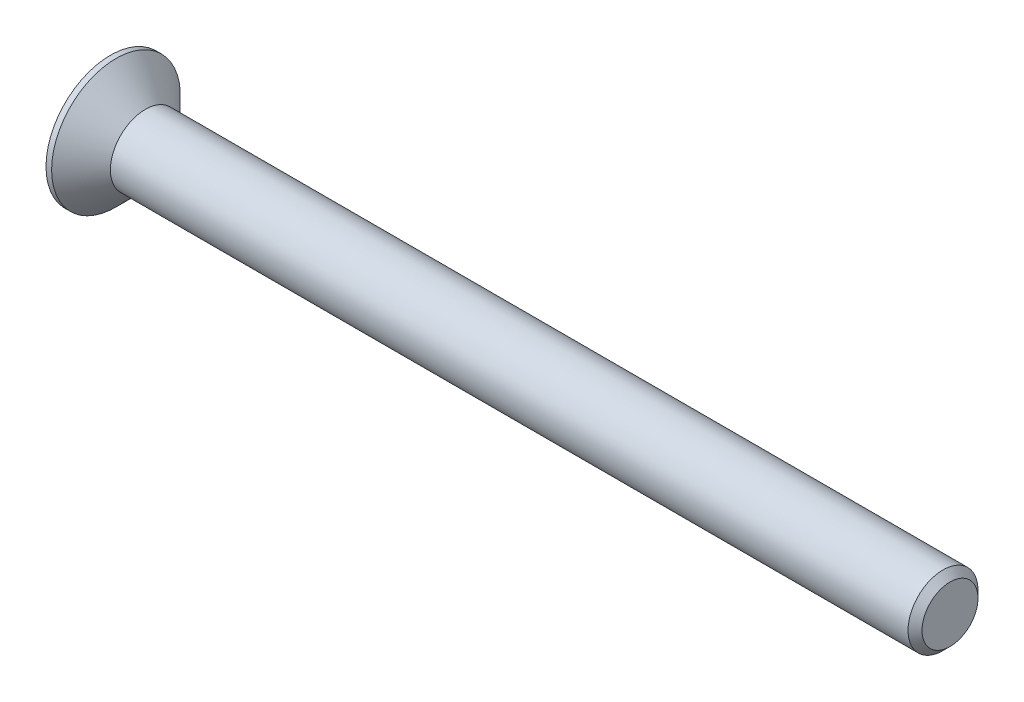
ISO-10303-21;
HEADER;
FILE_DESCRIPTION(('STEP AP214'),'2;1');
FILE_NAME('part.step','',(''),(''),'','','');
FILE_SCHEMA(('AUTOMOTIVE_DESIGN { 1 0 10303 214 1 1 1 1 }'));
ENDSEC;
DATA;
#1=APPLICATION_CONTEXT('core data for automotive mechanical design processes');
#2=APPLICATION_PROTOCOL_DEFINITION('international standard','automotive_design',2000,#1);
#3=PRODUCT_CONTEXT('',#1,'mechanical');
#4=PRODUCT('Part','Part','',(#3));
#5=PRODUCT_RELATED_PRODUCT_CATEGORY('part','',(#4));
#6=PRODUCT_DEFINITION_FORMATION('','',#4);
#7=PRODUCT_DEFINITION_CONTEXT('part definition',#1,'design');
#8=PRODUCT_DEFINITION('design','',#6,#7);
#9=PRODUCT_DEFINITION_SHAPE('','',#8);
#10=(LENGTH_UNIT() NAMED_UNIT(*) SI_UNIT(.MILLI.,.METRE.));
#11=(NAMED_UNIT(*) PLANE_ANGLE_UNIT() SI_UNIT($,.RADIAN.));
#12=(NAMED_UNIT(*) SI_UNIT($,.STERADIAN.) SOLID_ANGLE_UNIT());
#13=UNCERTAINTY_MEASURE_WITH_UNIT(LENGTH_MEASURE(1.E-05),#10,'distance_accuracy_value','');
#14=(GEOMETRIC_REPRESENTATION_CONTEXT(3) GLOBAL_UNCERTAINTY_ASSIGNED_CONTEXT((#13)) GLOBAL_UNIT_ASSIGNED_CONTEXT((#10,
#11,#12)) REPRESENTATION_CONTEXT('',''));
#15=CARTESIAN_POINT('',(0.,0.,0.));
#16=DIRECTION('',(0.,0.,1.));
#17=DIRECTION('',(1.,0.,0.));
#18=AXIS2_PLACEMENT_3D('',#15,#16,#17);
#19=CARTESIAN_POINT('',(0.,0.,0.));
#20=DIRECTION('',(-1.,0.,0.));
#21=DIRECTION('',(0.,0.,1.));
#22=AXIS2_PLACEMENT_3D('',#19,#20,#21);
#23=CONICAL_SURFACE('',#22,2.5,0.78539816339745);
#24=CARTESIAN_POINT('',(-2.09999999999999,0.,0.));
#25=DIRECTION('',(-1.,0.,0.));
#26=DIRECTION('',(0.,0.,1.));
#27=AXIS2_PLACEMENT_3D('',#24,#25,#26);
#28=CIRCLE('',#27,4.6);
#29=CARTESIAN_POINT('',(-2.09999999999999,0.,4.6));
#30=VERTEX_POINT('',#29);
#31=EDGE_CURVE('E189',#30,#30,#28,.T.);
#32=ORIENTED_EDGE('',*,*,#31,.F.);
#33=EDGE_LOOP('',(#32));
#34=FACE_BOUND('',#33,.T.);
#35=CARTESIAN_POINT('',(0.,0.,0.));
#36=DIRECTION('',(-1.,0.,0.));
#37=DIRECTION('',(0.,0.,1.));
#38=AXIS2_PLACEMENT_3D('',#35,#36,#37);
#39=CIRCLE('',#38,2.5);
#40=CARTESIAN_POINT('',(0.,0.,2.5));
#41=VERTEX_POINT('',#40);
#42=EDGE_CURVE('E212',#41,#41,#39,.T.);
#43=ORIENTED_EDGE('',*,*,#42,.T.);
#44=EDGE_LOOP('',(#43));
#45=FACE_BOUND('',#44,.T.);
#46=ADVANCED_FACE('F33',(#34,#45),#23,.T.);
#47=CARTESIAN_POINT('',(-2.5,0.,0.));
#48=DIRECTION('',(-1.,0.,0.));
#49=DIRECTION('',(0.,0.,1.));
#50=AXIS2_PLACEMENT_3D('',#47,#48,#49);
#51=CYLINDRICAL_SURFACE('',#50,2.5);
#52=CARTESIAN_POINT('',(57.,0.,0.));
#53=DIRECTION('',(-1.,0.,0.));
#54=DIRECTION('',(0.,0.,1.));
#55=AXIS2_PLACEMENT_3D('',#52,#53,#54);
#56=CIRCLE('',#55,2.5);
#57=CARTESIAN_POINT('',(57.,0.,2.5));
#58=VERTEX_POINT('',#57);
#59=EDGE_CURVE('E41',#58,#58,#56,.T.);
#60=ORIENTED_EDGE('',*,*,#59,.T.);
#61=EDGE_LOOP('',(#60));
#62=FACE_BOUND('',#61,.T.);
#63=ORIENTED_EDGE('',*,*,#42,.F.);
#64=EDGE_LOOP('',(#63));
#65=FACE_BOUND('',#64,.T.);
#66=ADVANCED_FACE('F217',(#62,#65),#51,.T.);
#67=CARTESIAN_POINT('',(57.5,0.,0.));
#68=DIRECTION('',(-1.,0.,0.));
#69=DIRECTION('',(0.,0.,1.));
#70=AXIS2_PLACEMENT_3D('',#67,#68,#69);
#71=PLANE('',#70);
#72=CARTESIAN_POINT('',(57.5,0.,0.));
#73=DIRECTION('',(-1.,0.,0.));
#74=DIRECTION('',(0.,0.,1.));
#75=AXIS2_PLACEMENT_3D('',#72,#73,#74);
#76=CIRCLE('',#75,2.);
#77=CARTESIAN_POINT('',(57.5,0.,2.));
#78=VERTEX_POINT('',#77);
#79=EDGE_CURVE('E11',#78,#78,#76,.F.);
#80=ORIENTED_EDGE('',*,*,#79,.T.);
#81=EDGE_LOOP('',(#80));
#82=FACE_BOUND('',#81,.T.);
#83=ADVANCED_FACE('F239',(#82),#71,.F.);
#84=CARTESIAN_POINT('',(-2.5,4.6,0.));
#85=DIRECTION('',(1.,0.,0.));
#86=DIRECTION('',(0.,0.,-1.));
#87=AXIS2_PLACEMENT_3D('',#84,#85,#86);
#88=PLANE('',#87);
#89=DIRECTION('',(0.,0.,-1.));
#90=VECTOR('',#89,1.);
#91=CARTESIAN_POINT('',(-2.5,0.575,-2.3));
#92=LINE('',#91,#90);
#93=CARTESIAN_POINT('',(-2.5,0.575,-0.575));
#94=VERTEX_POINT('',#93);
#95=CARTESIAN_POINT('',(-2.5,0.575,-2.3));
#96=VERTEX_POINT('',#95);
#97=EDGE_CURVE('E158',#94,#96,#92,.T.);
#98=ORIENTED_EDGE('',*,*,#97,.F.);
#99=DIRECTION('',(0.,-1.,0.));
#100=VECTOR('',#99,1.);
#101=CARTESIAN_POINT('',(-2.5,0.575,-0.575));
#102=LINE('',#101,#100);
#103=CARTESIAN_POINT('',(-2.5,2.3,-0.575));
#104=VERTEX_POINT('',#103);
#105=EDGE_CURVE('E48',#104,#94,#102,.T.);
#106=ORIENTED_EDGE('',*,*,#105,.F.);
#107=DIRECTION('',(0.,0.,-1.));
#108=VECTOR('',#107,1.);
#109=CARTESIAN_POINT('',(-2.5,2.3,-0.575));
#110=LINE('',#109,#108);
#111=CARTESIAN_POINT('',(-2.5,2.3,0.575));
#112=VERTEX_POINT('',#111);
#113=EDGE_CURVE('E185',#112,#104,#110,.T.);
#114=ORIENTED_EDGE('',*,*,#113,.F.);
#115=DIRECTION('',(0.,1.,0.));
#116=VECTOR('',#115,1.);
#117=CARTESIAN_POINT('',(-2.5,2.3,0.575));
#118=LINE('',#117,#116);
#119=CARTESIAN_POINT('',(-2.5,0.575,0.575));
#120=VERTEX_POINT('',#119);
#121=EDGE_CURVE('E183',#120,#112,#118,.T.);
#122=ORIENTED_EDGE('',*,*,#121,.F.);
#123=DIRECTION('',(0.,0.,-1.));
#124=VECTOR('',#123,1.);
#125=CARTESIAN_POINT('',(-2.5,0.575,0.575));
#126=LINE('',#125,#124);
#127=CARTESIAN_POINT('',(-2.5,0.575,2.3));
#128=VERTEX_POINT('',#127);
#129=EDGE_CURVE('E132',#128,#120,#126,.T.);
#130=ORIENTED_EDGE('',*,*,#129,.F.);
#131=DIRECTION('',(0.,1.,0.));
#132=VECTOR('',#131,1.);
#133=CARTESIAN_POINT('',(-2.5,0.575,2.3));
#134=LINE('',#133,#132);
#135=CARTESIAN_POINT('',(-2.5,-0.575,2.3));
#136=VERTEX_POINT('',#135);
#137=EDGE_CURVE('E179',#136,#128,#134,.T.);
#138=ORIENTED_EDGE('',*,*,#137,.F.);
#139=DIRECTION('',(0.,0.,1.));
#140=VECTOR('',#139,1.);
#141=CARTESIAN_POINT('',(-2.5,-0.575,2.3));
#142=LINE('',#141,#140);
#143=CARTESIAN_POINT('',(-2.5,-0.575,0.575));
#144=VERTEX_POINT('',#143);
#145=EDGE_CURVE('E176',#144,#136,#142,.T.);
#146=ORIENTED_EDGE('',*,*,#145,.F.);
#147=DIRECTION('',(0.,1.,0.));
#148=VECTOR('',#147,1.);
#149=CARTESIAN_POINT('',(-2.5,-0.575,0.575));
#150=LINE('',#149,#148);
#151=CARTESIAN_POINT('',(-2.5,-2.3,0.575));
#152=VERTEX_POINT('',#151);
#153=EDGE_CURVE('E173',#152,#144,#150,.T.);
#154=ORIENTED_EDGE('',*,*,#153,.F.);
#155=DIRECTION('',(0.,0.,1.));
#156=VECTOR('',#155,1.);
#157=CARTESIAN_POINT('',(-2.5,-2.3,0.575));
#158=LINE('',#157,#156);
#159=CARTESIAN_POINT('',(-2.5,-2.3,-0.575));
#160=VERTEX_POINT('',#159);
#161=EDGE_CURVE('E170',#160,#152,#158,.T.);
#162=ORIENTED_EDGE('',*,*,#161,.F.);
#163=DIRECTION('',(0.,-1.,0.));
#164=VECTOR('',#163,1.);
#165=CARTESIAN_POINT('',(-2.5,-2.3,-0.575));
#166=LINE('',#165,#164);
#167=CARTESIAN_POINT('',(-2.5,-0.575,-0.575));
#168=VERTEX_POINT('',#167);
#169=EDGE_CURVE('E167',#168,#160,#166,.T.);
#170=ORIENTED_EDGE('',*,*,#169,.F.);
#171=DIRECTION('',(0.,0.,1.));
#172=VECTOR('',#171,1.);
#173=CARTESIAN_POINT('',(-2.5,-0.575,-0.575));
#174=LINE('',#173,#172);
#175=CARTESIAN_POINT('',(-2.5,-0.575,-2.3));
#176=VERTEX_POINT('',#175);
#177=EDGE_CURVE('E164',#176,#168,#174,.T.);
#178=ORIENTED_EDGE('',*,*,#177,.F.);
#179=DIRECTION('',(0.,-1.,0.));
#180=VECTOR('',#179,1.);
#181=CARTESIAN_POINT('',(-2.5,-0.575,-2.3));
#182=LINE('',#181,#180);
#183=EDGE_CURVE('E161',#96,#176,#182,.T.);
#184=ORIENTED_EDGE('',*,*,#183,.F.);
#185=EDGE_LOOP('',(#98,#106,#114,#122,#130,#138,#146,#154,#162,#170,#178,#184));
#186=FACE_BOUND('',#185,.T.);
#187=CARTESIAN_POINT('',(-2.5,0.,0.));
#188=DIRECTION('',(-1.,0.,0.));
#189=DIRECTION('',(0.,0.,1.));
#190=AXIS2_PLACEMENT_3D('',#187,#188,#189);
#191=CIRCLE('',#190,4.6);
#192=CARTESIAN_POINT('',(-2.5,0.,4.6));
#193=VERTEX_POINT('',#192);
#194=EDGE_CURVE('E209',#193,#193,#191,.T.);
#195=ORIENTED_EDGE('',*,*,#194,.T.);
#196=EDGE_LOOP('',(#195));
#197=FACE_BOUND('',#196,.T.);
#198=ADVANCED_FACE('F230',(#186,#197),#88,.F.);
#199=CARTESIAN_POINT('',(-2.5,0.,0.));
#200=DIRECTION('',(-1.,0.,0.));
#201=DIRECTION('',(0.,0.,1.));
#202=AXIS2_PLACEMENT_3D('',#199,#200,#201);
#203=CYLINDRICAL_SURFACE('',#202,4.6);
#204=ORIENTED_EDGE('',*,*,#194,.F.);
#205=EDGE_LOOP('',(#204));
#206=FACE_BOUND('',#205,.T.);
#207=ORIENTED_EDGE('',*,*,#31,.T.);
#208=EDGE_LOOP('',(#207));
#209=FACE_BOUND('',#208,.T.);
#210=ADVANCED_FACE('F222',(#206,#209),#203,.T.);
#211=CARTESIAN_POINT('',(57.,0.,0.));
#212=DIRECTION('',(-1.,0.,0.));
#213=DIRECTION('',(0.,0.,1.));
#214=AXIS2_PLACEMENT_3D('',#211,#212,#213);
#215=CONICAL_SURFACE('',#214,2.5,0.785398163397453);
#216=ORIENTED_EDGE('',*,*,#79,.F.);
#217=EDGE_LOOP('',(#216));
#218=FACE_BOUND('',#217,.T.);
#219=ORIENTED_EDGE('',*,*,#59,.F.);
#220=EDGE_LOOP('',(#219));
#221=FACE_BOUND('',#220,.T.);
#222=ADVANCED_FACE('F35',(#218,#221),#215,.T.);
#223=CARTESIAN_POINT('',(-0.4,0.575,-0.575));
#224=DIRECTION('',(0.,0.,-1.));
#225=DIRECTION('',(-1.,0.,0.));
#226=AXIS2_PLACEMENT_3D('',#223,#224,#225);
#227=PLANE('',#226);
#228=ORIENTED_EDGE('',*,*,#105,.T.);
#229=DIRECTION('',(-1.,0.,0.));
#230=VECTOR('',#229,1.);
#231=CARTESIAN_POINT('',(-0.4,0.575,-0.575));
#232=LINE('',#231,#230);
#233=CARTESIAN_POINT('',(-0.4,0.575,-0.575));
#234=VERTEX_POINT('',#233);
#235=EDGE_CURVE('E96',#234,#94,#232,.T.);
#236=ORIENTED_EDGE('',*,*,#235,.F.);
#237=DIRECTION('',(0.,-1.,0.));
#238=VECTOR('',#237,1.);
#239=CARTESIAN_POINT('',(-0.4,0.575,-0.575));
#240=LINE('',#239,#238);
#241=CARTESIAN_POINT('',(-0.4,2.3,-0.575));
#242=VERTEX_POINT('',#241);
#243=EDGE_CURVE('E187',#242,#234,#240,.T.);
#244=ORIENTED_EDGE('',*,*,#243,.F.);
#245=DIRECTION('',(-1.,0.,0.));
#246=VECTOR('',#245,1.);
#247=CARTESIAN_POINT('',(-0.4,2.3,-0.575));
#248=LINE('',#247,#246);
#249=EDGE_CURVE('E56',#242,#104,#248,.T.);
#250=ORIENTED_EDGE('',*,*,#249,.T.);
#251=EDGE_LOOP('',(#228,#236,#244,#250));
#252=FACE_BOUND('',#251,.T.);
#253=ADVANCED_FACE('F221',(#252),#227,.F.);
#254=CARTESIAN_POINT('',(-0.4,2.3,-0.575));
#255=DIRECTION('',(0.,1.,0.));
#256=DIRECTION('',(-1.,0.,0.));
#257=AXIS2_PLACEMENT_3D('',#254,#255,#256);
#258=PLANE('',#257);
#259=ORIENTED_EDGE('',*,*,#113,.T.);
#260=ORIENTED_EDGE('',*,*,#249,.F.);
#261=DIRECTION('',(0.,0.,-1.));
#262=VECTOR('',#261,1.);
#263=CARTESIAN_POINT('',(-0.4,2.3,-0.575));
#264=LINE('',#263,#262);
#265=CARTESIAN_POINT('',(-0.4,2.3,0.575));
#266=VERTEX_POINT('',#265);
#267=EDGE_CURVE('E144',#266,#242,#264,.T.);
#268=ORIENTED_EDGE('',*,*,#267,.F.);
#269=DIRECTION('',(-1.,0.,0.));
#270=VECTOR('',#269,1.);
#271=CARTESIAN_POINT('',(-0.4,2.3,0.575));
#272=LINE('',#271,#270);
#273=EDGE_CURVE('E136',#266,#112,#272,.T.);
#274=ORIENTED_EDGE('',*,*,#273,.T.);
#275=EDGE_LOOP('',(#259,#260,#268,#274));
#276=FACE_BOUND('',#275,.T.);
#277=ADVANCED_FACE('F228',(#276),#258,.F.);
#278=CARTESIAN_POINT('',(-0.4,2.3,0.575));
#279=DIRECTION('',(0.,0.,1.));
#280=DIRECTION('',(1.,0.,0.));
#281=AXIS2_PLACEMENT_3D('',#278,#279,#280);
#282=PLANE('',#281);
#283=ORIENTED_EDGE('',*,*,#121,.T.);
#284=ORIENTED_EDGE('',*,*,#273,.F.);
#285=DIRECTION('',(0.,1.,0.));
#286=VECTOR('',#285,1.);
#287=CARTESIAN_POINT('',(-0.4,2.3,0.575));
#288=LINE('',#287,#286);
#289=CARTESIAN_POINT('',(-0.4,0.575,0.575));
#290=VERTEX_POINT('',#289);
#291=EDGE_CURVE('E140',#290,#266,#288,.T.);
#292=ORIENTED_EDGE('',*,*,#291,.F.);
#293=DIRECTION('',(-1.,0.,0.));
#294=VECTOR('',#293,1.);
#295=CARTESIAN_POINT('',(-0.4,0.575,0.575));
#296=LINE('',#295,#294);
#297=EDGE_CURVE('E125',#290,#120,#296,.T.);
#298=ORIENTED_EDGE('',*,*,#297,.T.);
#299=EDGE_LOOP('',(#283,#284,#292,#298));
#300=FACE_BOUND('',#299,.T.);
#301=ADVANCED_FACE('F141',(#300),#282,.F.);
#302=CARTESIAN_POINT('',(-0.4,0.575,0.575));
#303=DIRECTION('',(0.,1.,0.));
#304=DIRECTION('',(-1.,0.,0.));
#305=AXIS2_PLACEMENT_3D('',#302,#303,#304);
#306=PLANE('',#305);
#307=ORIENTED_EDGE('',*,*,#129,.T.);
#308=ORIENTED_EDGE('',*,*,#297,.F.);
#309=DIRECTION('',(0.,0.,-1.));
#310=VECTOR('',#309,1.);
#311=CARTESIAN_POINT('',(-0.4,0.575,0.575));
#312=LINE('',#311,#310);
#313=CARTESIAN_POINT('',(-0.4,0.575,2.3));
#314=VERTEX_POINT('',#313);
#315=EDGE_CURVE('E129',#314,#290,#312,.T.);
#316=ORIENTED_EDGE('',*,*,#315,.F.);
#317=DIRECTION('',(-1.,0.,0.));
#318=VECTOR('',#317,1.);
#319=CARTESIAN_POINT('',(-0.4,0.575,2.3));
#320=LINE('',#319,#318);
#321=EDGE_CURVE('E137',#314,#128,#320,.T.);
#322=ORIENTED_EDGE('',*,*,#321,.T.);
#323=EDGE_LOOP('',(#307,#308,#316,#322));
#324=FACE_BOUND('',#323,.T.);
#325=ADVANCED_FACE('F127',(#324),#306,.F.);
#326=CARTESIAN_POINT('',(-0.4,0.575,2.3));
#327=DIRECTION('',(0.,0.,1.));
#328=DIRECTION('',(1.,0.,0.));
#329=AXIS2_PLACEMENT_3D('',#326,#327,#328);
#330=PLANE('',#329);
#331=ORIENTED_EDGE('',*,*,#137,.T.);
#332=ORIENTED_EDGE('',*,*,#321,.F.);
#333=DIRECTION('',(0.,1.,0.));
#334=VECTOR('',#333,1.);
#335=CARTESIAN_POINT('',(-0.4,0.575,2.3));
#336=LINE('',#335,#334);
#337=CARTESIAN_POINT('',(-0.4,-0.575,2.3));
#338=VERTEX_POINT('',#337);
#339=EDGE_CURVE('E150',#338,#314,#336,.T.);
#340=ORIENTED_EDGE('',*,*,#339,.F.);
#341=DIRECTION('',(-1.,0.,0.));
#342=VECTOR('',#341,1.);
#343=CARTESIAN_POINT('',(-0.4,-0.575,2.3));
#344=LINE('',#343,#342);
#345=EDGE_CURVE('E192',#338,#136,#344,.T.);
#346=ORIENTED_EDGE('',*,*,#345,.T.);
#347=EDGE_LOOP('',(#331,#332,#340,#346));
#348=FACE_BOUND('',#347,.T.);
#349=ADVANCED_FACE('F277',(#348),#330,.F.);
#350=CARTESIAN_POINT('',(-0.4,-0.575,2.3));
#351=DIRECTION('',(0.,-1.,0.));
#352=DIRECTION('',(1.,0.,0.));
#353=AXIS2_PLACEMENT_3D('',#350,#351,#352);
#354=PLANE('',#353);
#355=ORIENTED_EDGE('',*,*,#145,.T.);
#356=ORIENTED_EDGE('',*,*,#345,.F.);
#357=DIRECTION('',(0.,0.,1.));
#358=VECTOR('',#357,1.);
#359=CARTESIAN_POINT('',(-0.4,-0.575,2.3));
#360=LINE('',#359,#358);
#361=CARTESIAN_POINT('',(-0.4,-0.575,0.575));
#362=VERTEX_POINT('',#361);
#363=EDGE_CURVE('E152',#362,#338,#360,.T.);
#364=ORIENTED_EDGE('',*,*,#363,.F.);
#365=DIRECTION('',(-1.,0.,0.));
#366=VECTOR('',#365,1.);
#367=CARTESIAN_POINT('',(-0.4,-0.575,0.575));
#368=LINE('',#367,#366);
#369=EDGE_CURVE('E194',#362,#144,#368,.T.);
#370=ORIENTED_EDGE('',*,*,#369,.T.);
#371=EDGE_LOOP('',(#355,#356,#364,#370));
#372=FACE_BOUND('',#371,.T.);
#373=ADVANCED_FACE('F273',(#372),#354,.F.);
#374=CARTESIAN_POINT('',(-0.4,-0.575,0.575));
#375=DIRECTION('',(0.,0.,1.));
#376=DIRECTION('',(1.,0.,0.));
#377=AXIS2_PLACEMENT_3D('',#374,#375,#376);
#378=PLANE('',#377);
#379=ORIENTED_EDGE('',*,*,#153,.T.);
#380=ORIENTED_EDGE('',*,*,#369,.F.);
#381=DIRECTION('',(0.,1.,0.));
#382=VECTOR('',#381,1.);
#383=CARTESIAN_POINT('',(-0.4,-0.575,0.575));
#384=LINE('',#383,#382);
#385=CARTESIAN_POINT('',(-0.4,-2.3,0.575));
#386=VERTEX_POINT('',#385);
#387=EDGE_CURVE('E422',#386,#362,#384,.T.);
#388=ORIENTED_EDGE('',*,*,#387,.F.);
#389=DIRECTION('',(-1.,0.,0.));
#390=VECTOR('',#389,1.);
#391=CARTESIAN_POINT('',(-0.4,-2.3,0.575));
#392=LINE('',#391,#390);
#393=EDGE_CURVE('E196',#386,#152,#392,.T.);
#394=ORIENTED_EDGE('',*,*,#393,.T.);
#395=EDGE_LOOP('',(#379,#380,#388,#394));
#396=FACE_BOUND('',#395,.T.);
#397=ADVANCED_FACE('F269',(#396),#378,.F.);
#398=CARTESIAN_POINT('',(-0.4,-2.3,0.575));
#399=DIRECTION('',(0.,-1.,0.));
#400=DIRECTION('',(1.,0.,0.));
#401=AXIS2_PLACEMENT_3D('',#398,#399,#400);
#402=PLANE('',#401);
#403=ORIENTED_EDGE('',*,*,#161,.T.);
#404=ORIENTED_EDGE('',*,*,#393,.F.);
#405=DIRECTION('',(0.,0.,1.));
#406=VECTOR('',#405,1.);
#407=CARTESIAN_POINT('',(-0.4,-2.3,0.575));
#408=LINE('',#407,#406);
#409=CARTESIAN_POINT('',(-0.4,-2.3,-0.575));
#410=VERTEX_POINT('',#409);
#411=EDGE_CURVE('E419',#410,#386,#408,.T.);
#412=ORIENTED_EDGE('',*,*,#411,.F.);
#413=DIRECTION('',(-1.,0.,0.));
#414=VECTOR('',#413,1.);
#415=CARTESIAN_POINT('',(-0.4,-2.3,-0.575));
#416=LINE('',#415,#414);
#417=EDGE_CURVE('E198',#410,#160,#416,.T.);
#418=ORIENTED_EDGE('',*,*,#417,.T.);
#419=EDGE_LOOP('',(#403,#404,#412,#418));
#420=FACE_BOUND('',#419,.T.);
#421=ADVANCED_FACE('F265',(#420),#402,.F.);
#422=CARTESIAN_POINT('',(-0.4,-2.3,-0.575));
#423=DIRECTION('',(0.,0.,-1.));
#424=DIRECTION('',(-1.,0.,0.));
#425=AXIS2_PLACEMENT_3D('',#422,#423,#424);
#426=PLANE('',#425);
#427=ORIENTED_EDGE('',*,*,#169,.T.);
#428=ORIENTED_EDGE('',*,*,#417,.F.);
#429=DIRECTION('',(0.,-1.,0.));
#430=VECTOR('',#429,1.);
#431=CARTESIAN_POINT('',(-0.4,-2.3,-0.575));
#432=LINE('',#431,#430);
#433=CARTESIAN_POINT('',(-0.4,-0.575,-0.575));
#434=VERTEX_POINT('',#433);
#435=EDGE_CURVE('E416',#434,#410,#432,.T.);
#436=ORIENTED_EDGE('',*,*,#435,.F.);
#437=DIRECTION('',(-1.,0.,0.));
#438=VECTOR('',#437,1.);
#439=CARTESIAN_POINT('',(-0.4,-0.575,-0.575));
#440=LINE('',#439,#438);
#441=EDGE_CURVE('E200',#434,#168,#440,.T.);
#442=ORIENTED_EDGE('',*,*,#441,.T.);
#443=EDGE_LOOP('',(#427,#428,#436,#442));
#444=FACE_BOUND('',#443,.T.);
#445=ADVANCED_FACE('F261',(#444),#426,.F.);
#446=CARTESIAN_POINT('',(-0.4,-0.575,-0.575));
#447=DIRECTION('',(0.,-1.,0.));
#448=DIRECTION('',(1.,0.,0.));
#449=AXIS2_PLACEMENT_3D('',#446,#447,#448);
#450=PLANE('',#449);
#451=ORIENTED_EDGE('',*,*,#177,.T.);
#452=ORIENTED_EDGE('',*,*,#441,.F.);
#453=DIRECTION('',(0.,0.,1.));
#454=VECTOR('',#453,1.);
#455=CARTESIAN_POINT('',(-0.4,-0.575,-0.575));
#456=LINE('',#455,#454);
#457=CARTESIAN_POINT('',(-0.4,-0.575,-2.3));
#458=VERTEX_POINT('',#457);
#459=EDGE_CURVE('E413',#458,#434,#456,.T.);
#460=ORIENTED_EDGE('',*,*,#459,.F.);
#461=DIRECTION('',(-1.,0.,0.));
#462=VECTOR('',#461,1.);
#463=CARTESIAN_POINT('',(-0.4,-0.575,-2.3));
#464=LINE('',#463,#462);
#465=EDGE_CURVE('E202',#458,#176,#464,.T.);
#466=ORIENTED_EDGE('',*,*,#465,.T.);
#467=EDGE_LOOP('',(#451,#452,#460,#466));
#468=FACE_BOUND('',#467,.T.);
#469=ADVANCED_FACE('F257',(#468),#450,.F.);
#470=CARTESIAN_POINT('',(-0.4,-0.575,-2.3));
#471=DIRECTION('',(0.,0.,-1.));
#472=DIRECTION('',(-1.,0.,0.));
#473=AXIS2_PLACEMENT_3D('',#470,#471,#472);
#474=PLANE('',#473);
#475=ORIENTED_EDGE('',*,*,#183,.T.);
#476=ORIENTED_EDGE('',*,*,#465,.F.);
#477=DIRECTION('',(0.,-1.,0.));
#478=VECTOR('',#477,1.);
#479=CARTESIAN_POINT('',(-0.4,-0.575,-2.3));
#480=LINE('',#479,#478);
#481=CARTESIAN_POINT('',(-0.4,0.575,-2.3));
#482=VERTEX_POINT('',#481);
#483=EDGE_CURVE('E408',#482,#458,#480,.T.);
#484=ORIENTED_EDGE('',*,*,#483,.F.);
#485=DIRECTION('',(-1.,0.,0.));
#486=VECTOR('',#485,1.);
#487=CARTESIAN_POINT('',(-0.4,0.575,-2.3));
#488=LINE('',#487,#486);
#489=EDGE_CURVE('E204',#482,#96,#488,.T.);
#490=ORIENTED_EDGE('',*,*,#489,.T.);
#491=EDGE_LOOP('',(#475,#476,#484,#490));
#492=FACE_BOUND('',#491,.T.);
#493=ADVANCED_FACE('F253',(#492),#474,.F.);
#494=CARTESIAN_POINT('',(-0.4,0.575,-2.3));
#495=DIRECTION('',(0.,1.,0.));
#496=DIRECTION('',(-1.,0.,0.));
#497=AXIS2_PLACEMENT_3D('',#494,#495,#496);
#498=PLANE('',#497);
#499=ORIENTED_EDGE('',*,*,#97,.T.);
#500=ORIENTED_EDGE('',*,*,#489,.F.);
#501=DIRECTION('',(0.,0.,-1.));
#502=VECTOR('',#501,1.);
#503=CARTESIAN_POINT('',(-0.4,0.575,-2.3));
#504=LINE('',#503,#502);
#505=EDGE_CURVE('E406',#234,#482,#504,.T.);
#506=ORIENTED_EDGE('',*,*,#505,.F.);
#507=ORIENTED_EDGE('',*,*,#235,.T.);
#508=EDGE_LOOP('',(#499,#500,#506,#507));
#509=FACE_BOUND('',#508,.T.);
#510=ADVANCED_FACE('F250',(#509),#498,.F.);
#511=CARTESIAN_POINT('',(-0.4,0.,0.));
#512=DIRECTION('',(1.,0.,0.));
#513=DIRECTION('',(0.,0.,-1.));
#514=AXIS2_PLACEMENT_3D('',#511,#512,#513);
#515=PLANE('',#514);
#516=ORIENTED_EDGE('',*,*,#243,.T.);
#517=ORIENTED_EDGE('',*,*,#505,.T.);
#518=ORIENTED_EDGE('',*,*,#483,.T.);
#519=ORIENTED_EDGE('',*,*,#459,.T.);
#520=ORIENTED_EDGE('',*,*,#435,.T.);
#521=ORIENTED_EDGE('',*,*,#411,.T.);
#522=ORIENTED_EDGE('',*,*,#387,.T.);
#523=ORIENTED_EDGE('',*,*,#363,.T.);
#524=ORIENTED_EDGE('',*,*,#339,.T.);
#525=ORIENTED_EDGE('',*,*,#315,.T.);
#526=ORIENTED_EDGE('',*,*,#291,.T.);
#527=ORIENTED_EDGE('',*,*,#267,.T.);
#528=EDGE_LOOP('',(#516,#517,#518,#519,#520,#521,#522,#523,#524,#525,#526,#527));
#529=FACE_BOUND('',#528,.T.);
#530=ADVANCED_FACE('F147',(#529),#515,.F.);
#531=CLOSED_SHELL('',(#46,#66,#83,#198,#210,#222,#253,#277,#301,#325,#349,#373,#397,#421,#445,
#469,#493,#510,#530));
#532=MANIFOLD_SOLID_BREP('B2',#531);
#533=ADVANCED_BREP_SHAPE_REPRESENTATION('',(#18,#532),#14);
#534=SHAPE_DEFINITION_REPRESENTATION(#9,#533);
ENDSEC;
END-ISO-10303-21;
